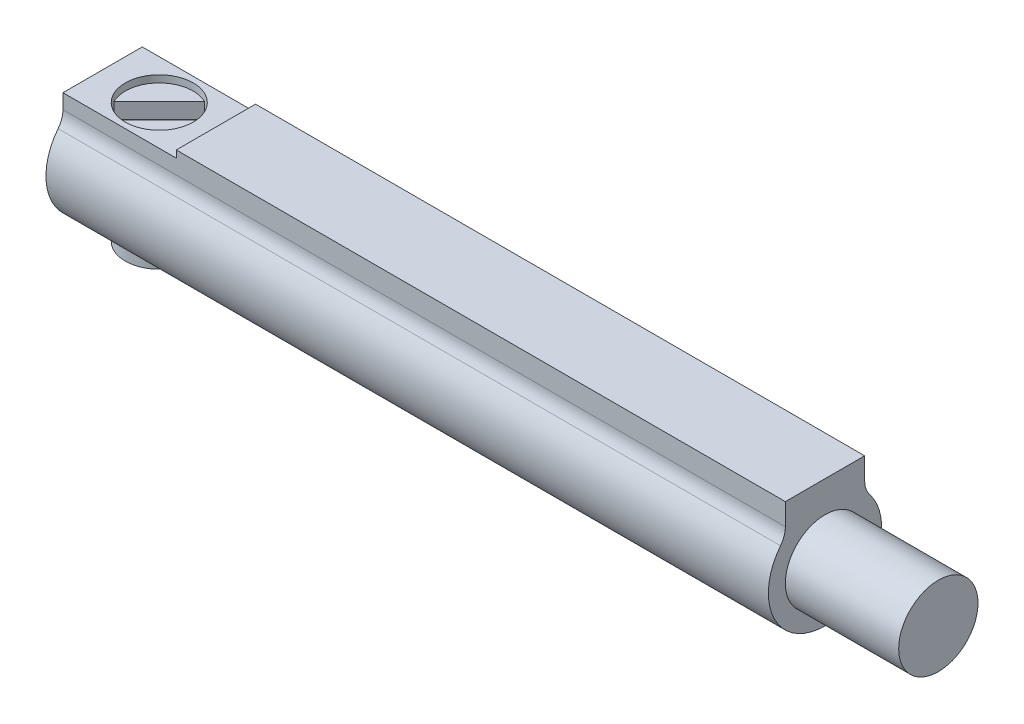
from build123d import *

# Parameters (mm, degrees)
EXTRUDE1_DEPTH     = 25.5
SKETCH3_R          = 1.4
EXTRUDE2_DEPTH     = 4
SKETCH2_W          = 2.8
SKETCH2_H          = 2
EXTRUDE3_DEPTH     = 21.5
SKETCH4_R          = 1.2
CUT_EXTRUDE1_DEPTH = 4.5
SKETCH5_W          = 1.2
SKETCH5_H          = 4
CUT_EXTRUDE2_START = -0.8
CUT_EXTRUDE2_DEPTH = 0.8


with BuildPart() as part:
    # Sketch1 → Extrude1 (new body)
    with BuildSketch(Plane(origin=(0, 0, 0), x_dir=(0, 0, -1), z_dir=(1, 0, 0))):
        with BuildLine():
            Line((1.4, 1.732051), (1.4, 2.25))
            Line((1.4, 2.25), (-1.4, 2.25))
            Line((-1.4, 2.25), (-1.4, 1.732051))
            ThreePointArc((-1.4, 1.732051), (-1.444071, 1.470189), (-1.571429, 1.237179))
            ThreePointArc((-1.571429, 1.237179), (0, -2), (1.571429, 1.237179))
            ThreePointArc((1.571429, 1.237179), (1.444071, 1.470189), (1.4, 1.732051))
        make_face()
    extrude(amount=EXTRUDE1_DEPTH)

    # Sketch3 → Extrude2 (add)
    with BuildSketch(Plane(origin=(25.5, 0, 0), x_dir=(0, 0, -1), z_dir=(1, 0, 0))):
        with Locations(Location((0, 0, 0), (0, 0, 180))):
            Circle(SKETCH3_R)
    extrude(amount=EXTRUDE2_DEPTH)

    # Sketch2 → Extrude3 (add)
    with BuildSketch(Plane(origin=(4, 0, 0), x_dir=(0, 0, -1), z_dir=(1, 0, 0))):
        with Locations((0, 1.5)):
            Rectangle(SKETCH2_W, SKETCH2_H)
    extrude(amount=EXTRUDE3_DEPTH)

    # Sketch4 → Cut-Extrude1 (cut)
    with BuildSketch(Plane(origin=(0, 2.25, 0), x_dir=(-1, 0, 0), z_dir=(0, 1, 0))):
        with Locations(Location((-2, 0, 0), (0, 0, 90))):
            Circle(SKETCH4_R)
    extrude(amount=-CUT_EXTRUDE1_DEPTH, mode=Mode.SUBTRACT)

    # Sketch5 → Revolve1 (revolve)
    with BuildSketch(Plane.XY, mode=Mode.PRIVATE) as revolve1_sk:
        with Locations((2.6, 0)):
            Rectangle(SKETCH5_W, SKETCH5_H)
    revolve(revolve1_sk.sketch.rotate(Axis((2, -2, 0), (0, 1, 0)), 270), axis=Axis((2, -2, 0), (0, 1, 0)))

    # Sketch6 → Cut-Extrude2 (cut)
    with BuildSketch(Plane(origin=(0, 2.25, 0), x_dir=(-1, 0, 0), z_dir=(0, 1, 0)).offset(CUT_EXTRUDE2_START)):
        with BuildLine():
            Line((-1.482843, 1.082843), (-3.082843, -0.517157))
            ThreePointArc((-3.082843, -0.517157), (-2.848528, -0.848528), (-2.517157, -1.082843))
            Line((-2.517157, -1.082843), (-0.917157, 0.517157))
            ThreePointArc((-0.917157, 0.517157), (-1.151472, 0.848528), (-1.482843, 1.082843))
        make_face()
    extrude(amount=CUT_EXTRUDE2_DEPTH, mode=Mode.SUBTRACT)


solid = part.part
